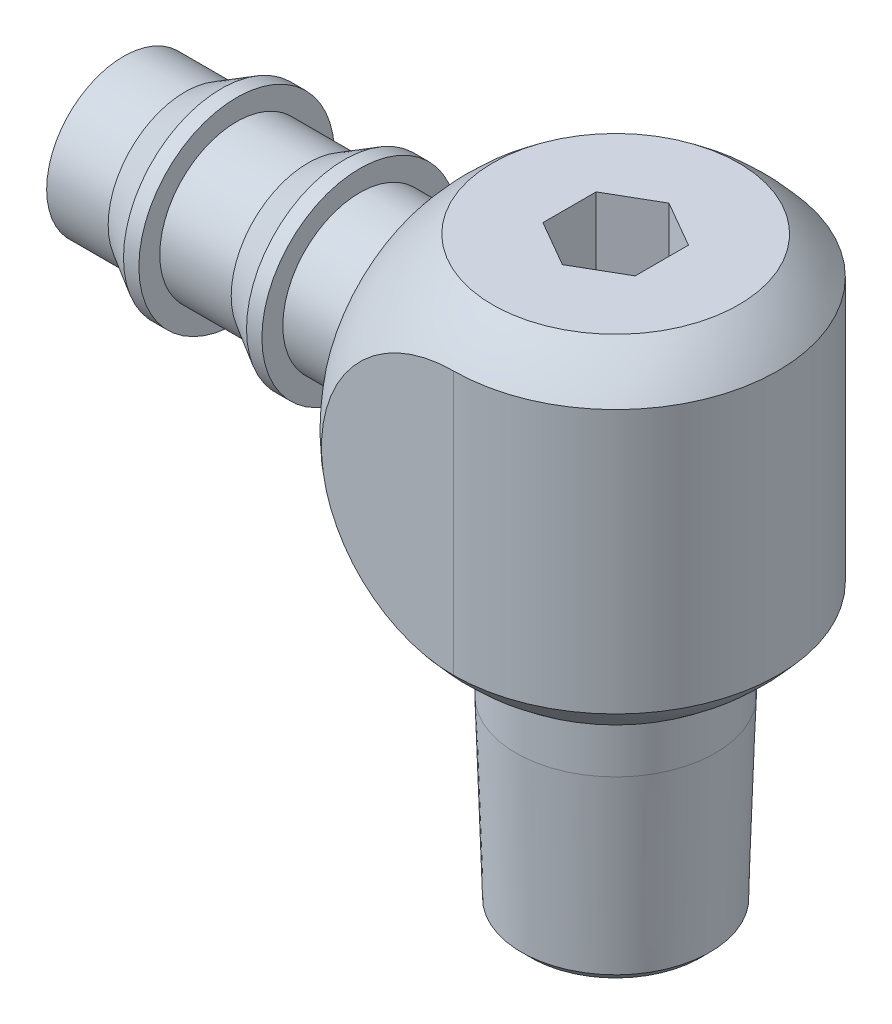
from build123d import *

# Parameters (mm, degrees)
CUT_EXTRUDE1_DEPTH      = 30.738319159
CUT_EXTRUDE1_DEPTH_BACK = 30.738319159
SKETCH3_OUTSIDE_W       = 31.068
SKETCH3_OUTSIDE_H       = 31.068
CUT_EXTRUDE2_DEPTH      = 29.139286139
CUT_EXTRUDE2_DEPTH_BACK = 29.139286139
SKETCH4_OUTSIDE_W       = 25.178
SKETCH4_OUTSIDE_H       = 30.004
SKETCH4_OUTSIDE_W_2     = 25.4
SKETCH4_OUTSIDE_H_2     = 17.4625
FILLET1_R               = 0.79375
CUT_EXTRUDE3_START      = -25.4
SKETCH10_R              = 2.69875
CUT_EXTRUDE3_DEPTH      = 25.4
SKETCH12_R              = 3.175
CUT_EXTRUDE4_DEPTH      = 24.13
CUT_EXTRUDE5_DEPTH      = 3.96875


with BuildPart() as part:
    # Sketch1 → Revolve1 (revolve)
    with BuildSketch(Plane.XY):
        with BuildLine():
            Line((0, 25.52065), (0, 3.93065))
            ThreePointArc((0, 3.93065), (10.795, 14.72565), (0, 25.52065))
        make_face()
    revolve(axis=Axis((0, 0, 0), (0, 1, 0)))

    # Sketch3 outside → Cut-Extrude1 (cut, two sides: drawn at the far end of the back side and taken through both)
    with BuildSketch(Plane(origin=(0, 0, 0), x_dir=(1, 0, 0), z_dir=(0, 1, 0)).offset(-CUT_EXTRUDE1_DEPTH_BACK)):
        Rectangle(SKETCH3_OUTSIDE_W, SKETCH3_OUTSIDE_H)
        with BuildLine():
            Line((0, -8.382), (-8.382, -8.382))
            Line((-8.382, -8.382), (-8.382, 8.382))
            Line((-8.382, 8.382), (0, 8.382))
            ThreePointArc((0, 8.382), (8.382, 0), (0, -8.382))
        make_face(mode=Mode.SUBTRACT)
    extrude(amount=CUT_EXTRUDE1_DEPTH + CUT_EXTRUDE1_DEPTH_BACK, mode=Mode.SUBTRACT)

    # Sketch4 outside → Cut-Extrude2 (cut, two sides: drawn at the far end of the back side and taken through both)
    with BuildSketch(Plane.XY.offset(-CUT_EXTRUDE2_DEPTH_BACK)):
        with Locations((0, 14.726)):
            Rectangle(SKETCH4_OUTSIDE_W, SKETCH4_OUTSIDE_H)
        with Locations((0, 14.72565)):
            Rectangle(SKETCH4_OUTSIDE_W_2, SKETCH4_OUTSIDE_H_2, mode=Mode.SUBTRACT)
    extrude(amount=CUT_EXTRUDE2_DEPTH + CUT_EXTRUDE2_DEPTH_BACK, mode=Mode.SUBTRACT)

    # Sketch9 → Revolve2 (revolve)
    with BuildSketch(Plane(origin=(0, 14.72565, 0), x_dir=(1, 0, 0), z_dir=(0, 1, 0)), mode=Mode.PRIVATE) as revolve2_sk:
        Polygon((-25.4, 0), (-25.4, 3.96875), (-22.225, 3.96875), (-20.355251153, 5.04825), (-19.561501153, 5.04825), (-19.561501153, 3.96875), (-15.875, 3.96875), (-14.005251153, 5.04825), (-13.211501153, 5.04825), (-13.211501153, 3.96875), (0, 3.96875), (0, 0), align=None)
    revolve(revolve2_sk.sketch.rotate(Axis((0, 14.72565, 0), (1, 0, 0)), 180), axis=Axis((0, 14.72565, 0), (1, 0, 0)))

    # Fillet1
    fillet1_edges = [part.edges().sort_by_distance(p)[0] for p in [
        (-8.382, 14.72565, -3.96875),
    ]]
    fillet(fillet1_edges, radius=FILLET1_R)

    # Sketch10 → Cut-Extrude3 (cut)
    with BuildSketch(Plane.ZY.offset(25.4).offset(CUT_EXTRUDE3_START)):
        with Locations((0, 14.72565)):
            Circle(SKETCH10_R)
    extrude(amount=CUT_EXTRUDE3_DEPTH, mode=Mode.SUBTRACT)

    # Sketch11 → Revolve3 (revolve)
    with BuildSketch(Plane.XY, mode=Mode.PRIVATE) as revolve3_sk:
        Polygon((4.860824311, -6.226275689), (5.1435, 2.8194), (5.1435, 5.9944), (0, 5.9944), (0, -6.7056), (4.3815, -6.7056), align=None)
    revolve(revolve3_sk.sketch.rotate(Axis((0, -15.711606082, 0), (0, 1, 0)), 90), axis=Axis((0, -15.711606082, 0), (0, 1, 0)))

    # Sketch12 → Cut-Extrude4 (cut)
    with BuildSketch(Plane.XZ.offset(6.7056)):
        with Locations(Location((0, 0, 0), (0, 0, 270))):
            Circle(SKETCH12_R)
    extrude(amount=-CUT_EXTRUDE4_DEPTH, mode=Mode.SUBTRACT)

    # Sketch13 → Cut-Extrude5 (cut)
    with BuildSketch(Plane(origin=(0, 23.4569, 0), x_dir=(1, 0, 0), z_dir=(0, 1, 0))):
        Polygon((0, 2.749630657), (-2.38125, 1.374815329), (-2.38125, -1.374815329), (0, -2.749630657), (2.38125, -1.374815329), (2.38125, 1.374815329), align=None)
    extrude(amount=-CUT_EXTRUDE5_DEPTH, mode=Mode.SUBTRACT)


solid = part.part
